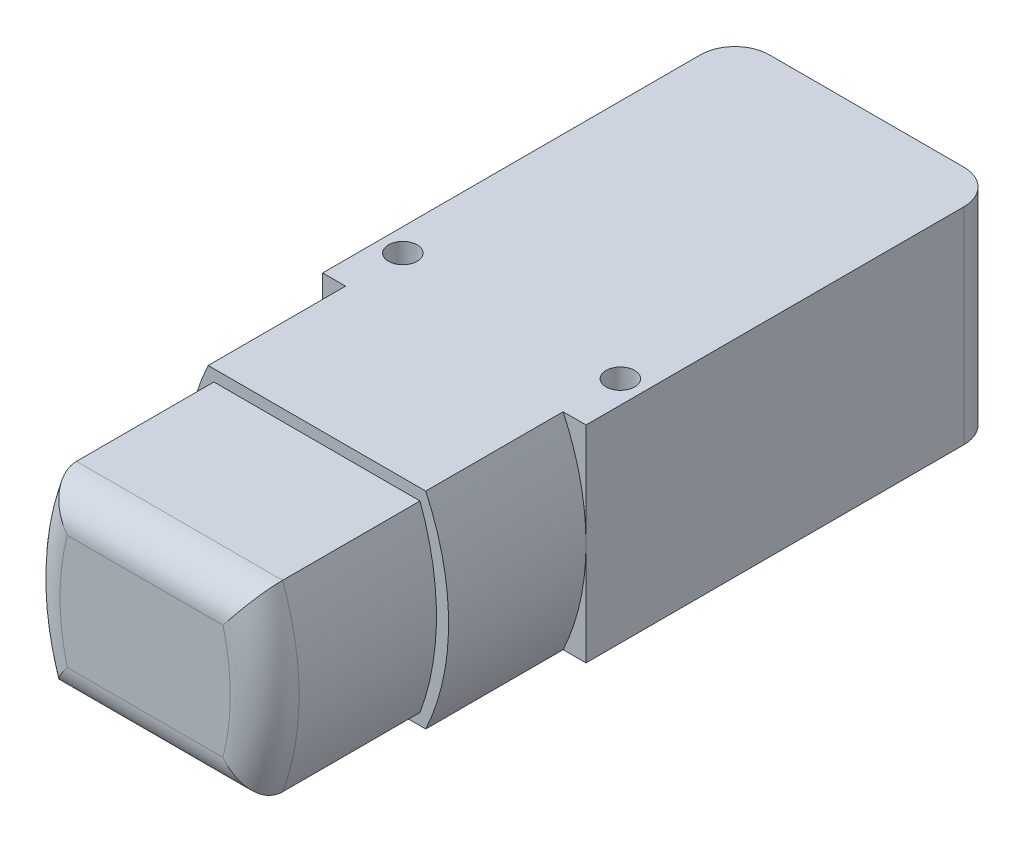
ISO-10303-21;
HEADER;
FILE_DESCRIPTION(('STEP AP214'),'2;1');
FILE_NAME('part.step','',(''),(''),'','','');
FILE_SCHEMA(('AUTOMOTIVE_DESIGN { 1 0 10303 214 1 1 1 1 }'));
ENDSEC;
DATA;
#1=APPLICATION_CONTEXT('core data for automotive mechanical design processes');
#2=APPLICATION_PROTOCOL_DEFINITION('international standard','automotive_design',2000,#1);
#3=PRODUCT_CONTEXT('',#1,'mechanical');
#4=PRODUCT('Part','Part','',(#3));
#5=PRODUCT_RELATED_PRODUCT_CATEGORY('part','',(#4));
#6=PRODUCT_DEFINITION_FORMATION('','',#4);
#7=PRODUCT_DEFINITION_CONTEXT('part definition',#1,'design');
#8=PRODUCT_DEFINITION('design','',#6,#7);
#9=PRODUCT_DEFINITION_SHAPE('','',#8);
#10=(LENGTH_UNIT() NAMED_UNIT(*) SI_UNIT(.MILLI.,.METRE.));
#11=(NAMED_UNIT(*) PLANE_ANGLE_UNIT() SI_UNIT($,.RADIAN.));
#12=(NAMED_UNIT(*) SI_UNIT($,.STERADIAN.) SOLID_ANGLE_UNIT());
#13=UNCERTAINTY_MEASURE_WITH_UNIT(LENGTH_MEASURE(1.E-05),#10,'distance_accuracy_value','');
#14=(GEOMETRIC_REPRESENTATION_CONTEXT(3) GLOBAL_UNCERTAINTY_ASSIGNED_CONTEXT((#13)) GLOBAL_UNIT_ASSIGNED_CONTEXT((#10,
#11,#12)) REPRESENTATION_CONTEXT('',''));
#15=CARTESIAN_POINT('',(0.,0.,0.));
#16=DIRECTION('',(0.,0.,1.));
#17=DIRECTION('',(1.,0.,0.));
#18=AXIS2_PLACEMENT_3D('',#15,#16,#17);
#19=CARTESIAN_POINT('',(9.75000000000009,0.,48.));
#20=DIRECTION('',(0.,0.,1.));
#21=DIRECTION('',(1.,0.,0.));
#22=AXIS2_PLACEMENT_3D('',#19,#20,#21);
#23=PLANE('',#22);
#24=CARTESIAN_POINT('',(9.75000000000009,0.,48.));
#25=DIRECTION('',(0.,0.,1.));
#26=DIRECTION('',(1.,0.,0.));
#27=AXIS2_PLACEMENT_3D('',#24,#25,#26);
#28=CIRCLE('',#27,21.2500000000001);
#29=CARTESIAN_POINT('',(-9.5,9.,48.));
#30=VERTEX_POINT('',#29);
#31=CARTESIAN_POINT('',(-9.5,-9.,48.));
#32=VERTEX_POINT('',#31);
#33=EDGE_CURVE('E194',#30,#32,#28,.T.);
#34=ORIENTED_EDGE('',*,*,#33,.T.);
#35=DIRECTION('',(1.,0.,0.));
#36=VECTOR('',#35,1.);
#37=CARTESIAN_POINT('',(-9.5,-9.,48.));
#38=LINE('',#37,#36);
#39=CARTESIAN_POINT('',(9.5,-8.99999999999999,48.));
#40=VERTEX_POINT('',#39);
#41=EDGE_CURVE('E197',#32,#40,#38,.T.);
#42=ORIENTED_EDGE('',*,*,#41,.T.);
#43=CARTESIAN_POINT('',(-9.75000000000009,0.,48.));
#44=DIRECTION('',(0.,0.,1.));
#45=DIRECTION('',(-1.,0.,0.));
#46=AXIS2_PLACEMENT_3D('',#43,#44,#45);
#47=CIRCLE('',#46,21.2500000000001);
#48=CARTESIAN_POINT('',(9.5,9.,48.));
#49=VERTEX_POINT('',#48);
#50=EDGE_CURVE('E200',#40,#49,#47,.T.);
#51=ORIENTED_EDGE('',*,*,#50,.T.);
#52=DIRECTION('',(-1.,0.,0.));
#53=VECTOR('',#52,1.);
#54=CARTESIAN_POINT('',(-9.5,9.,48.));
#55=LINE('',#54,#53);
#56=EDGE_CURVE('E202',#49,#30,#55,.T.);
#57=ORIENTED_EDGE('',*,*,#56,.T.);
#58=EDGE_LOOP('',(#34,#42,#51,#57));
#59=FACE_BOUND('',#58,.T.);
#60=DIRECTION('',(1.,0.,0.));
#61=VECTOR('',#60,1.);
#62=CARTESIAN_POINT('',(-9.,-8.,48.));
#63=LINE('',#62,#61);
#64=CARTESIAN_POINT('',(-9.,-8.,48.));
#65=VERTEX_POINT('',#64);
#66=CARTESIAN_POINT('',(9.,-7.99999999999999,48.));
#67=VERTEX_POINT('',#66);
#68=EDGE_CURVE('E169',#65,#67,#63,.T.);
#69=ORIENTED_EDGE('',*,*,#68,.F.);
#70=CARTESIAN_POINT('',(12.5638586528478,0.,48.));
#71=DIRECTION('',(0.,0.,1.));
#72=DIRECTION('',(1.,0.,0.));
#73=AXIS2_PLACEMENT_3D('',#70,#71,#72);
#74=CIRCLE('',#73,23.);
#75=CARTESIAN_POINT('',(-9.,8.,48.));
#76=VERTEX_POINT('',#75);
#77=EDGE_CURVE('E175',#76,#65,#74,.T.);
#78=ORIENTED_EDGE('',*,*,#77,.F.);
#79=DIRECTION('',(-1.,0.,0.));
#80=VECTOR('',#79,1.);
#81=CARTESIAN_POINT('',(-9.,8.,48.));
#82=LINE('',#81,#80);
#83=CARTESIAN_POINT('',(9.,8.,48.));
#84=VERTEX_POINT('',#83);
#85=EDGE_CURVE('E185',#84,#76,#82,.T.);
#86=ORIENTED_EDGE('',*,*,#85,.F.);
#87=CARTESIAN_POINT('',(-12.5638586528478,0.,48.));
#88=DIRECTION('',(0.,0.,1.));
#89=DIRECTION('',(-1.,0.,0.));
#90=AXIS2_PLACEMENT_3D('',#87,#88,#89);
#91=CIRCLE('',#90,23.);
#92=EDGE_CURVE('E183',#67,#84,#91,.T.);
#93=ORIENTED_EDGE('',*,*,#92,.F.);
#94=EDGE_LOOP('',(#69,#78,#86,#93));
#95=FACE_BOUND('',#94,.T.);
#96=ADVANCED_FACE('F44',(#59,#95),#23,.T.);
#97=CARTESIAN_POINT('',(0.,0.,36.));
#98=DIRECTION('',(0.,0.,1.));
#99=DIRECTION('',(1.,0.,0.));
#100=AXIS2_PLACEMENT_3D('',#97,#98,#99);
#101=PLANE('',#100);
#102=CARTESIAN_POINT('',(9.75000000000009,0.,36.));
#103=DIRECTION('',(0.,0.,1.));
#104=DIRECTION('',(1.,0.,0.));
#105=AXIS2_PLACEMENT_3D('',#102,#103,#104);
#106=CIRCLE('',#105,21.2500000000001);
#107=CARTESIAN_POINT('',(-9.5,9.,36.));
#108=VERTEX_POINT('',#107);
#109=CARTESIAN_POINT('',(-11.5,0.,36.));
#110=VERTEX_POINT('',#109);
#111=EDGE_CURVE('E171',#108,#110,#106,.T.);
#112=ORIENTED_EDGE('',*,*,#111,.F.);
#113=DIRECTION('',(-1.,0.,0.));
#114=VECTOR('',#113,1.);
#115=CARTESIAN_POINT('',(-11.5,9.,36.));
#116=LINE('',#115,#114);
#117=CARTESIAN_POINT('',(-11.5,9.,36.));
#118=VERTEX_POINT('',#117);
#119=EDGE_CURVE('E226',#108,#118,#116,.T.);
#120=ORIENTED_EDGE('',*,*,#119,.T.);
#121=DIRECTION('',(0.,-1.,0.));
#122=VECTOR('',#121,1.);
#123=CARTESIAN_POINT('',(-11.5,9.,36.));
#124=LINE('',#123,#122);
#125=EDGE_CURVE('E231',#118,#110,#124,.T.);
#126=ORIENTED_EDGE('',*,*,#125,.T.);
#127=EDGE_LOOP('',(#112,#120,#126));
#128=FACE_BOUND('',#127,.T.);
#129=ADVANCED_FACE('F342',(#128),#101,.T.);
#130=CARTESIAN_POINT('',(-9.5,-9.,36.));
#131=VERTEX_POINT('',#130);
#132=EDGE_CURVE('E207',#110,#131,#106,.T.);
#133=ORIENTED_EDGE('',*,*,#132,.F.);
#134=CARTESIAN_POINT('',(-11.5,-9.,36.));
#135=VERTEX_POINT('',#134);
#136=EDGE_CURVE('E230',#110,#135,#124,.T.);
#137=ORIENTED_EDGE('',*,*,#136,.T.);
#138=DIRECTION('',(1.,0.,0.));
#139=VECTOR('',#138,1.);
#140=CARTESIAN_POINT('',(-11.5,-9.,36.));
#141=LINE('',#140,#139);
#142=EDGE_CURVE('E235',#135,#131,#141,.T.);
#143=ORIENTED_EDGE('',*,*,#142,.T.);
#144=EDGE_LOOP('',(#133,#137,#143));
#145=FACE_BOUND('',#144,.T.);
#146=ADVANCED_FACE('F348',(#145),#101,.T.);
#147=CARTESIAN_POINT('',(-9.75000000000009,0.,36.));
#148=DIRECTION('',(0.,0.,1.));
#149=DIRECTION('',(-1.,0.,0.));
#150=AXIS2_PLACEMENT_3D('',#147,#148,#149);
#151=CIRCLE('',#150,21.2500000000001);
#152=CARTESIAN_POINT('',(9.5,-9.,36.));
#153=VERTEX_POINT('',#152);
#154=CARTESIAN_POINT('',(11.5,0.,36.));
#155=VERTEX_POINT('',#154);
#156=EDGE_CURVE('E198',#153,#155,#151,.T.);
#157=ORIENTED_EDGE('',*,*,#156,.F.);
#158=CARTESIAN_POINT('',(11.5,-9.,36.));
#159=VERTEX_POINT('',#158);
#160=EDGE_CURVE('E234',#153,#159,#141,.T.);
#161=ORIENTED_EDGE('',*,*,#160,.T.);
#162=DIRECTION('',(0.,1.,0.));
#163=VECTOR('',#162,1.);
#164=CARTESIAN_POINT('',(11.5,9.,36.));
#165=LINE('',#164,#163);
#166=EDGE_CURVE('E223',#159,#155,#165,.T.);
#167=ORIENTED_EDGE('',*,*,#166,.T.);
#168=EDGE_LOOP('',(#157,#161,#167));
#169=FACE_BOUND('',#168,.T.);
#170=ADVANCED_FACE('F368',(#169),#101,.T.);
#171=CARTESIAN_POINT('',(11.5,9.,36.));
#172=DIRECTION('',(-1.,0.,0.));
#173=DIRECTION('',(0.,-1.,0.));
#174=AXIS2_PLACEMENT_3D('',#171,#172,#173);
#175=PLANE('',#174);
#176=DIRECTION('',(0.,0.,-1.));
#177=VECTOR('',#176,1.);
#178=CARTESIAN_POINT('',(11.5,-9.,36.));
#179=LINE('',#178,#177);
#180=CARTESIAN_POINT('',(11.5,-9.,3.));
#181=VERTEX_POINT('',#180);
#182=EDGE_CURVE('E237',#159,#181,#179,.T.);
#183=ORIENTED_EDGE('',*,*,#182,.T.);
#184=DIRECTION('',(0.,1.,0.));
#185=VECTOR('',#184,1.);
#186=CARTESIAN_POINT('',(11.5,9.,3.));
#187=LINE('',#186,#185);
#188=CARTESIAN_POINT('',(11.5,9.,3.));
#189=VERTEX_POINT('',#188);
#190=EDGE_CURVE('E254',#181,#189,#187,.T.);
#191=ORIENTED_EDGE('',*,*,#190,.T.);
#192=DIRECTION('',(0.,0.,-1.));
#193=VECTOR('',#192,1.);
#194=CARTESIAN_POINT('',(11.5,9.,36.));
#195=LINE('',#194,#193);
#196=CARTESIAN_POINT('',(11.5,9.,36.));
#197=VERTEX_POINT('',#196);
#198=EDGE_CURVE('E251',#197,#189,#195,.T.);
#199=ORIENTED_EDGE('',*,*,#198,.F.);
#200=EDGE_CURVE('E227',#155,#197,#165,.T.);
#201=ORIENTED_EDGE('',*,*,#200,.F.);
#202=ORIENTED_EDGE('',*,*,#166,.F.);
#203=EDGE_LOOP('',(#183,#191,#199,#201,#202));
#204=FACE_BOUND('',#203,.T.);
#205=ADVANCED_FACE('F383',(#204),#175,.F.);
#206=CARTESIAN_POINT('',(-11.5,9.,36.));
#207=DIRECTION('',(0.,-1.,0.));
#208=DIRECTION('',(0.,0.,-1.));
#209=AXIS2_PLACEMENT_3D('',#206,#207,#208);
#210=PLANE('',#209);
#211=CARTESIAN_POINT('',(9.5,9.00000000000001,31.));
#212=DIRECTION('',(0.,-1.,0.));
#213=DIRECTION('',(0.,0.,-1.));
#214=AXIS2_PLACEMENT_3D('',#211,#212,#213);
#215=CIRCLE('',#214,1.25);
#216=CARTESIAN_POINT('',(9.5,9.00000000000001,29.75));
#217=VERTEX_POINT('',#216);
#218=EDGE_CURVE('E582',#217,#217,#215,.T.);
#219=ORIENTED_EDGE('',*,*,#218,.T.);
#220=EDGE_LOOP('',(#219));
#221=FACE_BOUND('',#220,.T.);
#222=CARTESIAN_POINT('',(-9.5,9.00000000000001,31.));
#223=DIRECTION('',(0.,-1.,0.));
#224=DIRECTION('',(0.,0.,-1.));
#225=AXIS2_PLACEMENT_3D('',#222,#223,#224);
#226=CIRCLE('',#225,1.25);
#227=CARTESIAN_POINT('',(-9.5,9.00000000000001,29.75));
#228=VERTEX_POINT('',#227);
#229=EDGE_CURVE('E295',#228,#228,#226,.T.);
#230=ORIENTED_EDGE('',*,*,#229,.T.);
#231=EDGE_LOOP('',(#230));
#232=FACE_BOUND('',#231,.T.);
#233=ORIENTED_EDGE('',*,*,#198,.T.);
#234=CARTESIAN_POINT('',(8.5,9.,3.));
#235=DIRECTION('',(0.,-1.,0.));
#236=DIRECTION('',(0.,0.,-1.));
#237=AXIS2_PLACEMENT_3D('',#234,#235,#236);
#238=CIRCLE('',#237,3.);
#239=CARTESIAN_POINT('',(8.49999999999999,9.,0.));
#240=VERTEX_POINT('',#239);
#241=EDGE_CURVE('E259',#189,#240,#238,.F.);
#242=ORIENTED_EDGE('',*,*,#241,.T.);
#243=DIRECTION('',(-1.,0.,0.));
#244=VECTOR('',#243,1.);
#245=CARTESIAN_POINT('',(-11.5,9.,0.));
#246=LINE('',#245,#244);
#247=CARTESIAN_POINT('',(-8.5,9.,0.));
#248=VERTEX_POINT('',#247);
#249=EDGE_CURVE('E222',#240,#248,#246,.T.);
#250=ORIENTED_EDGE('',*,*,#249,.T.);
#251=CARTESIAN_POINT('',(-8.5,9.,3.));
#252=DIRECTION('',(0.,-1.,0.));
#253=DIRECTION('',(0.,0.,-1.));
#254=AXIS2_PLACEMENT_3D('',#251,#252,#253);
#255=CIRCLE('',#254,3.);
#256=CARTESIAN_POINT('',(-11.5,9.,3.));
#257=VERTEX_POINT('',#256);
#258=EDGE_CURVE('E257',#248,#257,#255,.F.);
#259=ORIENTED_EDGE('',*,*,#258,.T.);
#260=DIRECTION('',(0.,0.,-1.));
#261=VECTOR('',#260,1.);
#262=CARTESIAN_POINT('',(-11.5,9.,36.));
#263=LINE('',#262,#261);
#264=EDGE_CURVE('E248',#118,#257,#263,.T.);
#265=ORIENTED_EDGE('',*,*,#264,.F.);
#266=ORIENTED_EDGE('',*,*,#119,.F.);
#267=DIRECTION('',(0.,0.,-1.));
#268=VECTOR('',#267,1.);
#269=CARTESIAN_POINT('',(-9.5,9.,48.));
#270=LINE('',#269,#268);
#271=EDGE_CURVE('E204',#30,#108,#270,.T.);
#272=ORIENTED_EDGE('',*,*,#271,.F.);
#273=ORIENTED_EDGE('',*,*,#56,.F.);
#274=DIRECTION('',(0.,0.,-1.));
#275=VECTOR('',#274,1.);
#276=CARTESIAN_POINT('',(9.5,9.,48.));
#277=LINE('',#276,#275);
#278=CARTESIAN_POINT('',(9.5,9.,36.));
#279=VERTEX_POINT('',#278);
#280=EDGE_CURVE('E213',#49,#279,#277,.T.);
#281=ORIENTED_EDGE('',*,*,#280,.T.);
#282=EDGE_CURVE('E228',#197,#279,#116,.T.);
#283=ORIENTED_EDGE('',*,*,#282,.F.);
#284=EDGE_LOOP('',(#233,#242,#250,#259,#265,#266,#272,#273,#281,#283));
#285=FACE_BOUND('',#284,.T.);
#286=ADVANCED_FACE('F379',(#221,#232,#285),#210,.F.);
#287=CARTESIAN_POINT('',(-11.5,9.,36.));
#288=DIRECTION('',(1.,0.,0.));
#289=DIRECTION('',(0.,1.,0.));
#290=AXIS2_PLACEMENT_3D('',#287,#288,#289);
#291=PLANE('',#290);
#292=ORIENTED_EDGE('',*,*,#264,.T.);
#293=DIRECTION('',(0.,-1.,0.));
#294=VECTOR('',#293,1.);
#295=CARTESIAN_POINT('',(-11.5,9.,3.));
#296=LINE('',#295,#294);
#297=CARTESIAN_POINT('',(-11.5,-9.,3.));
#298=VERTEX_POINT('',#297);
#299=EDGE_CURVE('E269',#257,#298,#296,.T.);
#300=ORIENTED_EDGE('',*,*,#299,.T.);
#301=DIRECTION('',(0.,0.,-1.));
#302=VECTOR('',#301,1.);
#303=CARTESIAN_POINT('',(-11.5,-9.,36.));
#304=LINE('',#303,#302);
#305=EDGE_CURVE('E245',#135,#298,#304,.T.);
#306=ORIENTED_EDGE('',*,*,#305,.F.);
#307=ORIENTED_EDGE('',*,*,#136,.F.);
#308=ORIENTED_EDGE('',*,*,#125,.F.);
#309=EDGE_LOOP('',(#292,#300,#306,#307,#308));
#310=FACE_BOUND('',#309,.T.);
#311=ADVANCED_FACE('F375',(#310),#291,.F.);
#312=CARTESIAN_POINT('',(-11.5,-9.,36.));
#313=DIRECTION('',(0.,1.,0.));
#314=DIRECTION('',(0.,0.,1.));
#315=AXIS2_PLACEMENT_3D('',#312,#313,#314);
#316=PLANE('',#315);
#317=CARTESIAN_POINT('',(9.5,-9.,31.));
#318=DIRECTION('',(0.,-1.,0.));
#319=DIRECTION('',(0.,0.,-1.));
#320=AXIS2_PLACEMENT_3D('',#317,#318,#319);
#321=CIRCLE('',#320,1.25);
#322=CARTESIAN_POINT('',(9.5,-9.,29.75));
#323=VERTEX_POINT('',#322);
#324=EDGE_CURVE('E585',#323,#323,#321,.T.);
#325=ORIENTED_EDGE('',*,*,#324,.F.);
#326=EDGE_LOOP('',(#325));
#327=FACE_BOUND('',#326,.T.);
#328=CARTESIAN_POINT('',(-9.5,-9.,31.));
#329=DIRECTION('',(0.,-1.,0.));
#330=DIRECTION('',(0.,0.,-1.));
#331=AXIS2_PLACEMENT_3D('',#328,#329,#330);
#332=CIRCLE('',#331,1.25);
#333=CARTESIAN_POINT('',(-9.5,-9.,29.75));
#334=VERTEX_POINT('',#333);
#335=EDGE_CURVE('E587',#334,#334,#332,.T.);
#336=ORIENTED_EDGE('',*,*,#335,.F.);
#337=EDGE_LOOP('',(#336));
#338=FACE_BOUND('',#337,.T.);
#339=DIRECTION('',(1.,0.,0.));
#340=VECTOR('',#339,1.);
#341=CARTESIAN_POINT('',(-11.5,-9.,0.));
#342=LINE('',#341,#340);
#343=CARTESIAN_POINT('',(-8.5,-9.,0.));
#344=VERTEX_POINT('',#343);
#345=CARTESIAN_POINT('',(8.5,-9.,0.));
#346=VERTEX_POINT('',#345);
#347=EDGE_CURVE('E240',#344,#346,#342,.T.);
#348=ORIENTED_EDGE('',*,*,#347,.T.);
#349=CARTESIAN_POINT('',(8.5,-9.,3.));
#350=DIRECTION('',(0.,1.,0.));
#351=DIRECTION('',(0.,0.,1.));
#352=AXIS2_PLACEMENT_3D('',#349,#350,#351);
#353=CIRCLE('',#352,3.);
#354=EDGE_CURVE('E267',#346,#181,#353,.F.);
#355=ORIENTED_EDGE('',*,*,#354,.T.);
#356=ORIENTED_EDGE('',*,*,#182,.F.);
#357=ORIENTED_EDGE('',*,*,#160,.F.);
#358=DIRECTION('',(0.,0.,-1.));
#359=VECTOR('',#358,1.);
#360=CARTESIAN_POINT('',(9.5,-8.99999999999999,48.));
#361=LINE('',#360,#359);
#362=EDGE_CURVE('E216',#40,#153,#361,.T.);
#363=ORIENTED_EDGE('',*,*,#362,.F.);
#364=ORIENTED_EDGE('',*,*,#41,.F.);
#365=DIRECTION('',(0.,0.,-1.));
#366=VECTOR('',#365,1.);
#367=CARTESIAN_POINT('',(-9.5,-9.,48.));
#368=LINE('',#367,#366);
#369=EDGE_CURVE('E219',#32,#131,#368,.T.);
#370=ORIENTED_EDGE('',*,*,#369,.T.);
#371=ORIENTED_EDGE('',*,*,#142,.F.);
#372=ORIENTED_EDGE('',*,*,#305,.T.);
#373=CARTESIAN_POINT('',(-8.5,-9.,3.));
#374=DIRECTION('',(0.,1.,0.));
#375=DIRECTION('',(0.,0.,1.));
#376=AXIS2_PLACEMENT_3D('',#373,#374,#375);
#377=CIRCLE('',#376,3.);
#378=EDGE_CURVE('E265',#298,#344,#377,.F.);
#379=ORIENTED_EDGE('',*,*,#378,.T.);
#380=EDGE_LOOP('',(#348,#355,#356,#357,#363,#364,#370,#371,#372,#379));
#381=FACE_BOUND('',#380,.T.);
#382=ADVANCED_FACE('F366',(#327,#338,#381),#316,.F.);
#383=EDGE_CURVE('E210',#155,#279,#151,.T.);
#384=ORIENTED_EDGE('',*,*,#383,.F.);
#385=ORIENTED_EDGE('',*,*,#200,.T.);
#386=ORIENTED_EDGE('',*,*,#282,.T.);
#387=EDGE_LOOP('',(#384,#385,#386));
#388=FACE_BOUND('',#387,.T.);
#389=ADVANCED_FACE('F351',(#388),#101,.T.);
#390=CARTESIAN_POINT('',(0.,0.,0.));
#391=DIRECTION('',(0.,0.,1.));
#392=DIRECTION('',(1.,0.,0.));
#393=AXIS2_PLACEMENT_3D('',#390,#391,#392);
#394=PLANE('',#393);
#395=ORIENTED_EDGE('',*,*,#249,.F.);
#396=DIRECTION('',(0.,1.,0.));
#397=VECTOR('',#396,1.);
#398=CARTESIAN_POINT('',(8.5,0.,0.));
#399=LINE('',#398,#397);
#400=EDGE_CURVE('E263',#240,#346,#399,.F.);
#401=ORIENTED_EDGE('',*,*,#400,.T.);
#402=ORIENTED_EDGE('',*,*,#347,.F.);
#403=DIRECTION('',(0.,-1.,0.));
#404=VECTOR('',#403,1.);
#405=CARTESIAN_POINT('',(-8.5,0.,0.));
#406=LINE('',#405,#404);
#407=EDGE_CURVE('E261',#344,#248,#406,.F.);
#408=ORIENTED_EDGE('',*,*,#407,.T.);
#409=EDGE_LOOP('',(#395,#401,#402,#408));
#410=FACE_BOUND('',#409,.T.);
#411=ADVANCED_FACE('F365',(#410),#394,.F.);
#412=CARTESIAN_POINT('',(8.5,9.,3.));
#413=DIRECTION('',(0.,1.,0.));
#414=DIRECTION('',(-1.,0.,0.));
#415=AXIS2_PLACEMENT_3D('',#412,#413,#414);
#416=CYLINDRICAL_SURFACE('',#415,3.);
#417=ORIENTED_EDGE('',*,*,#354,.F.);
#418=ORIENTED_EDGE('',*,*,#400,.F.);
#419=ORIENTED_EDGE('',*,*,#241,.F.);
#420=ORIENTED_EDGE('',*,*,#190,.F.);
#421=EDGE_LOOP('',(#417,#418,#419,#420));
#422=FACE_BOUND('',#421,.T.);
#423=ADVANCED_FACE('F371',(#422),#416,.T.);
#424=CARTESIAN_POINT('',(-8.5,9.,3.));
#425=DIRECTION('',(0.,-1.,0.));
#426=DIRECTION('',(1.,0.,0.));
#427=AXIS2_PLACEMENT_3D('',#424,#425,#426);
#428=CYLINDRICAL_SURFACE('',#427,3.);
#429=ORIENTED_EDGE('',*,*,#258,.F.);
#430=ORIENTED_EDGE('',*,*,#407,.F.);
#431=ORIENTED_EDGE('',*,*,#378,.F.);
#432=ORIENTED_EDGE('',*,*,#299,.F.);
#433=EDGE_LOOP('',(#429,#430,#431,#432));
#434=FACE_BOUND('',#433,.T.);
#435=ADVANCED_FACE('F361',(#434),#428,.T.);
#436=CARTESIAN_POINT('',(9.75000000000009,0.,48.));
#437=DIRECTION('',(0.,0.,-1.));
#438=DIRECTION('',(-1.,0.,0.));
#439=AXIS2_PLACEMENT_3D('',#436,#437,#438);
#440=CYLINDRICAL_SURFACE('',#439,21.2500000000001);
#441=ORIENTED_EDGE('',*,*,#111,.T.);
#442=ORIENTED_EDGE('',*,*,#132,.T.);
#443=ORIENTED_EDGE('',*,*,#369,.F.);
#444=ORIENTED_EDGE('',*,*,#33,.F.);
#445=ORIENTED_EDGE('',*,*,#271,.T.);
#446=EDGE_LOOP('',(#441,#442,#443,#444,#445));
#447=FACE_BOUND('',#446,.T.);
#448=ADVANCED_FACE('F358',(#447),#440,.T.);
#449=CARTESIAN_POINT('',(-9.75000000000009,0.,48.));
#450=DIRECTION('',(0.,0.,-1.));
#451=DIRECTION('',(-1.,0.,0.));
#452=AXIS2_PLACEMENT_3D('',#449,#450,#451);
#453=CYLINDRICAL_SURFACE('',#452,21.2500000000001);
#454=ORIENTED_EDGE('',*,*,#156,.T.);
#455=ORIENTED_EDGE('',*,*,#383,.T.);
#456=ORIENTED_EDGE('',*,*,#280,.F.);
#457=ORIENTED_EDGE('',*,*,#50,.F.);
#458=ORIENTED_EDGE('',*,*,#362,.T.);
#459=EDGE_LOOP('',(#454,#455,#456,#457,#458));
#460=FACE_BOUND('',#459,.T.);
#461=ADVANCED_FACE('F355',(#460),#453,.T.);
#462=CARTESIAN_POINT('',(12.5638586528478,0.,63.));
#463=DIRECTION('',(0.,0.,-1.));
#464=DIRECTION('',(-1.,0.,0.));
#465=AXIS2_PLACEMENT_3D('',#462,#463,#464);
#466=CYLINDRICAL_SURFACE('',#465,23.);
#467=DIRECTION('',(0.,0.,-1.));
#468=VECTOR('',#467,1.);
#469=CARTESIAN_POINT('',(-9.,-8.,63.));
#470=LINE('',#469,#468);
#471=CARTESIAN_POINT('',(-9.,-8.,60.));
#472=VERTEX_POINT('',#471);
#473=EDGE_CURVE('E165',#472,#65,#470,.T.);
#474=ORIENTED_EDGE('',*,*,#473,.F.);
#475=CARTESIAN_POINT('',(12.5638586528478,0.,60.));
#476=DIRECTION('',(0.,0.,1.));
#477=DIRECTION('',(1.,0.,0.));
#478=AXIS2_PLACEMENT_3D('',#475,#476,#477);
#479=CIRCLE('',#478,23.);
#480=CARTESIAN_POINT('',(-9.,8.,60.));
#481=VERTEX_POINT('',#480);
#482=EDGE_CURVE('E57',#472,#481,#479,.F.);
#483=ORIENTED_EDGE('',*,*,#482,.T.);
#484=DIRECTION('',(0.,0.,-1.));
#485=VECTOR('',#484,1.);
#486=CARTESIAN_POINT('',(-9.,8.,63.));
#487=LINE('',#486,#485);
#488=EDGE_CURVE('E177',#481,#76,#487,.T.);
#489=ORIENTED_EDGE('',*,*,#488,.T.);
#490=ORIENTED_EDGE('',*,*,#77,.T.);
#491=EDGE_LOOP('',(#474,#483,#489,#490));
#492=FACE_BOUND('',#491,.T.);
#493=ADVANCED_FACE('F176',(#492),#466,.T.);
#494=CARTESIAN_POINT('',(-9.,-8.,63.));
#495=DIRECTION('',(0.,1.,0.));
#496=DIRECTION('',(-1.,0.,0.));
#497=AXIS2_PLACEMENT_3D('',#494,#495,#496);
#498=PLANE('',#497);
#499=DIRECTION('',(0.,0.,-1.));
#500=VECTOR('',#499,1.);
#501=CARTESIAN_POINT('',(9.,-7.99999999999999,63.));
#502=LINE('',#501,#500);
#503=CARTESIAN_POINT('',(9.,-7.99999999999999,60.));
#504=VERTEX_POINT('',#503);
#505=EDGE_CURVE('E172',#504,#67,#502,.T.);
#506=ORIENTED_EDGE('',*,*,#505,.F.);
#507=DIRECTION('',(1.,0.,0.));
#508=VECTOR('',#507,1.);
#509=CARTESIAN_POINT('',(-9.,-8.,60.));
#510=LINE('',#509,#508);
#511=EDGE_CURVE('E13',#504,#472,#510,.F.);
#512=ORIENTED_EDGE('',*,*,#511,.T.);
#513=ORIENTED_EDGE('',*,*,#473,.T.);
#514=ORIENTED_EDGE('',*,*,#68,.T.);
#515=EDGE_LOOP('',(#506,#512,#513,#514));
#516=FACE_BOUND('',#515,.T.);
#517=ADVANCED_FACE('F167',(#516),#498,.F.);
#518=CARTESIAN_POINT('',(-12.5638586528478,0.,63.));
#519=DIRECTION('',(0.,0.,-1.));
#520=DIRECTION('',(-1.,0.,0.));
#521=AXIS2_PLACEMENT_3D('',#518,#519,#520);
#522=CYLINDRICAL_SURFACE('',#521,23.);
#523=DIRECTION('',(0.,0.,-1.));
#524=VECTOR('',#523,1.);
#525=CARTESIAN_POINT('',(9.,8.,63.));
#526=LINE('',#525,#524);
#527=CARTESIAN_POINT('',(9.,8.,60.));
#528=VERTEX_POINT('',#527);
#529=EDGE_CURVE('E191',#528,#84,#526,.T.);
#530=ORIENTED_EDGE('',*,*,#529,.F.);
#531=CARTESIAN_POINT('',(-12.5638586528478,0.,60.));
#532=DIRECTION('',(0.,0.,1.));
#533=DIRECTION('',(1.,0.,0.));
#534=AXIS2_PLACEMENT_3D('',#531,#532,#533);
#535=CIRCLE('',#534,23.);
#536=EDGE_CURVE('E281',#528,#504,#535,.F.);
#537=ORIENTED_EDGE('',*,*,#536,.T.);
#538=ORIENTED_EDGE('',*,*,#505,.T.);
#539=ORIENTED_EDGE('',*,*,#92,.T.);
#540=EDGE_LOOP('',(#530,#537,#538,#539));
#541=FACE_BOUND('',#540,.T.);
#542=ADVANCED_FACE('F328',(#541),#522,.T.);
#543=CARTESIAN_POINT('',(-9.,8.,63.));
#544=DIRECTION('',(0.,-1.,0.));
#545=DIRECTION('',(0.,0.,-1.));
#546=AXIS2_PLACEMENT_3D('',#543,#544,#545);
#547=PLANE('',#546);
#548=ORIENTED_EDGE('',*,*,#488,.F.);
#549=DIRECTION('',(-1.,0.,0.));
#550=VECTOR('',#549,1.);
#551=CARTESIAN_POINT('',(9.,8.,60.));
#552=LINE('',#551,#550);
#553=EDGE_CURVE('E284',#481,#528,#552,.F.);
#554=ORIENTED_EDGE('',*,*,#553,.T.);
#555=ORIENTED_EDGE('',*,*,#529,.T.);
#556=ORIENTED_EDGE('',*,*,#85,.T.);
#557=EDGE_LOOP('',(#548,#554,#555,#556));
#558=FACE_BOUND('',#557,.T.);
#559=ADVANCED_FACE('F330',(#558),#547,.F.);
#560=CARTESIAN_POINT('',(12.5638586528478,0.,63.));
#561=DIRECTION('',(0.,0.,1.));
#562=DIRECTION('',(1.,0.,0.));
#563=AXIS2_PLACEMENT_3D('',#560,#561,#562);
#564=PLANE('',#563);
#565=DIRECTION('',(1.,0.,0.));
#566=VECTOR('',#565,1.);
#567=CARTESIAN_POINT('',(9.,-5.,63.));
#568=LINE('',#567,#566);
#569=CARTESIAN_POINT('',(-6.80105807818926,-5.,63.));
#570=VERTEX_POINT('',#569);
#571=CARTESIAN_POINT('',(6.80105807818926,-5.,63.));
#572=VERTEX_POINT('',#571);
#573=EDGE_CURVE('E272',#570,#572,#568,.T.);
#574=ORIENTED_EDGE('',*,*,#573,.T.);
#575=CARTESIAN_POINT('',(-12.5638586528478,0.,63.));
#576=DIRECTION('',(0.,0.,1.));
#577=DIRECTION('',(1.,0.,0.));
#578=AXIS2_PLACEMENT_3D('',#575,#576,#577);
#579=CIRCLE('',#578,20.);
#580=CARTESIAN_POINT('',(6.80105807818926,5.,63.));
#581=VERTEX_POINT('',#580);
#582=EDGE_CURVE('E278',#572,#581,#579,.T.);
#583=ORIENTED_EDGE('',*,*,#582,.T.);
#584=DIRECTION('',(-1.,0.,0.));
#585=VECTOR('',#584,1.);
#586=CARTESIAN_POINT('',(-9.,5.,63.));
#587=LINE('',#586,#585);
#588=CARTESIAN_POINT('',(-6.80105807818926,5.,63.));
#589=VERTEX_POINT('',#588);
#590=EDGE_CURVE('E276',#581,#589,#587,.T.);
#591=ORIENTED_EDGE('',*,*,#590,.T.);
#592=CARTESIAN_POINT('',(12.5638586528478,0.,63.));
#593=DIRECTION('',(0.,0.,1.));
#594=DIRECTION('',(1.,0.,0.));
#595=AXIS2_PLACEMENT_3D('',#592,#593,#594);
#596=CIRCLE('',#595,20.);
#597=EDGE_CURVE('E274',#589,#570,#596,.T.);
#598=ORIENTED_EDGE('',*,*,#597,.T.);
#599=EDGE_LOOP('',(#574,#583,#591,#598));
#600=FACE_BOUND('',#599,.T.);
#601=ADVANCED_FACE('F333',(#600),#564,.T.);
#602=CARTESIAN_POINT('',(12.5638586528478,0.,60.));
#603=DIRECTION('',(0.,0.,1.));
#604=DIRECTION('',(1.,0.,0.));
#605=AXIS2_PLACEMENT_3D('',#602,#603,#604);
#606=TOROIDAL_SURFACE('',#605,20.,3.);
#607=CARTESIAN_POINT('',(-9.,8.,60.));
#608=CARTESIAN_POINT('',(-9.00000879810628,8.00001410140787,60.0734416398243));
#609=CARTESIAN_POINT('',(-8.9981243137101,7.99730356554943,60.1468749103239));
#610=CARTESIAN_POINT('',(-8.99063643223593,7.98654109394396,60.2931286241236));
#611=CARTESIAN_POINT('',(-8.98503457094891,7.97849136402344,60.3659493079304));
#612=CARTESIAN_POINT('',(-8.9702175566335,7.9572128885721,60.510073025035));
#613=CARTESIAN_POINT('',(-8.96102107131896,7.94401090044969,60.5813819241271));
#614=CARTESIAN_POINT('',(-8.93914614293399,7.9126365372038,60.722336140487));
#615=CARTESIAN_POINT('',(-8.9264674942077,7.8944638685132,60.791981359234));
#616=CARTESIAN_POINT('',(-8.88346796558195,7.83289967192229,60.9975276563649));
#617=CARTESIAN_POINT('',(-8.84815027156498,7.78241402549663,61.1303549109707));
#618=CARTESIAN_POINT('',(-8.76577493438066,7.66505271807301,61.3846214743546));
#619=CARTESIAN_POINT('',(-8.71870473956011,7.59815953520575,61.5060484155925));
#620=CARTESIAN_POINT('',(-8.61137784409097,7.44625316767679,61.7426388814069));
#621=CARTESIAN_POINT('',(-8.55048901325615,7.36037969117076,61.8569602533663));
#622=CARTESIAN_POINT('',(-8.41950268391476,7.17657202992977,62.0693699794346));
#623=CARTESIAN_POINT('',(-8.34940274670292,7.07863465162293,62.1674540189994));
#624=CARTESIAN_POINT('',(-8.1893585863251,6.85628689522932,62.3621063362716));
#625=CARTESIAN_POINT('',(-8.09806063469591,6.73019602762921,62.4556367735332));
#626=CARTESIAN_POINT('',(-7.90778870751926,6.46930905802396,62.6201062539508));
#627=CARTESIAN_POINT('',(-7.80880677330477,6.3345039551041,62.6910214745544));
#628=CARTESIAN_POINT('',(-7.58570104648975,6.03300194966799,62.8222123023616));
#629=CARTESIAN_POINT('',(-7.46039991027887,5.86515285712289,62.8778278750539));
#630=CARTESIAN_POINT('',(-7.20491723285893,5.52627365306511,62.958603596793));
#631=CARTESIAN_POINT('',(-7.07474216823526,5.35524790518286,62.9838027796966));
#632=CARTESIAN_POINT('',(-6.89835818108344,5.12586132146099,62.9979335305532));
#633=CARTESIAN_POINT('',(-6.8531675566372,5.06729516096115,62.9998155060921));
#634=CARTESIAN_POINT('',(-6.80560271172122,5.00586761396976,62.9999956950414));
#635=CARTESIAN_POINT('',(-6.80333052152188,5.00293371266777,62.9999999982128));
#636=CARTESIAN_POINT('',(-6.80105807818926,5.,63.));
#637=B_SPLINE_CURVE_WITH_KNOTS('',3,(#607,#608,#609,#610,#611,#612,#613,#614,#615,#616,#617,
#618,#619,#620,#621,#622,#623,#624,#625,#626,#627,#628,#629,#630,#631,#632,#633,#634,#635,#636),
.UNSPECIFIED.,.F.,.F.,(4,2,2,2,2,2,2,2,2,2,2,2,2,2,4),(0.,0.220236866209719,0.440382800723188,
0.659400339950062,0.878430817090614,1.31554155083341,1.75312113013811,2.21756404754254,
2.68213017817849,3.22494355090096,3.76832684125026,4.41608290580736,5.06300680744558,
5.28494541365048,5.29607805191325),.UNSPECIFIED.);
#638=EDGE_CURVE('E309',#481,#589,#637,.T.);
#639=ORIENTED_EDGE('',*,*,#638,.F.);
#640=ORIENTED_EDGE('',*,*,#482,.F.);
#641=CARTESIAN_POINT('',(-9.,-8.,60.));
#642=CARTESIAN_POINT('',(-9.00000879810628,-8.00001410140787,60.0734416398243));
#643=CARTESIAN_POINT('',(-8.9981243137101,-7.99730356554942,60.1468749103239));
#644=CARTESIAN_POINT('',(-8.99063643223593,-7.98654109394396,60.2931286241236));
#645=CARTESIAN_POINT('',(-8.98503457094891,-7.97849136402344,60.3659493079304));
#646=CARTESIAN_POINT('',(-8.9702175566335,-7.9572128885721,60.510073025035));
#647=CARTESIAN_POINT('',(-8.96102107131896,-7.94401090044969,60.5813819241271));
#648=CARTESIAN_POINT('',(-8.93914614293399,-7.9126365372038,60.722336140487));
#649=CARTESIAN_POINT('',(-8.9264674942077,-7.8944638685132,60.791981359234));
#650=CARTESIAN_POINT('',(-8.88346796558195,-7.83289967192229,60.9975276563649));
#651=CARTESIAN_POINT('',(-8.84815027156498,-7.78241402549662,61.1303549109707));
#652=CARTESIAN_POINT('',(-8.76577493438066,-7.665052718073,61.3846214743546));
#653=CARTESIAN_POINT('',(-8.71870473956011,-7.59815953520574,61.5060484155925));
#654=CARTESIAN_POINT('',(-8.61137784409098,-7.44625316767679,61.7426388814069));
#655=CARTESIAN_POINT('',(-8.55048901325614,-7.36037969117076,61.8569602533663));
#656=CARTESIAN_POINT('',(-8.41950268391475,-7.17657202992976,62.0693699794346));
#657=CARTESIAN_POINT('',(-8.34940274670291,-7.07863465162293,62.1674540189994));
#658=CARTESIAN_POINT('',(-8.18935858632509,-6.85628689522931,62.3621063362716));
#659=CARTESIAN_POINT('',(-8.09806063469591,-6.7301960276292,62.4556367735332));
#660=CARTESIAN_POINT('',(-7.90778870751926,-6.46930905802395,62.6201062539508));
#661=CARTESIAN_POINT('',(-7.80880677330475,-6.33450395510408,62.6910214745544));
#662=CARTESIAN_POINT('',(-7.58570104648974,-6.03300194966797,62.8222123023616));
#663=CARTESIAN_POINT('',(-7.46039991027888,-5.86515285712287,62.8778278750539));
#664=CARTESIAN_POINT('',(-7.20491723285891,-5.52627365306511,62.958603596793));
#665=CARTESIAN_POINT('',(-7.0747421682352,-5.3552479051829,62.9838027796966));
#666=CARTESIAN_POINT('',(-6.89835818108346,-5.12586132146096,62.9979335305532));
#667=CARTESIAN_POINT('',(-6.85316755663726,-5.0672951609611,62.9998155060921));
#668=CARTESIAN_POINT('',(-6.80560271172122,-5.00586761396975,62.9999956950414));
#669=CARTESIAN_POINT('',(-6.80333052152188,-5.00293371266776,62.9999999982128));
#670=CARTESIAN_POINT('',(-6.80105807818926,-5.,63.));
#671=B_SPLINE_CURVE_WITH_KNOTS('',3,(#641,#642,#643,#644,#645,#646,#647,#648,#649,#650,#651,
#652,#653,#654,#655,#656,#657,#658,#659,#660,#661,#662,#663,#664,#665,#666,#667,#668,#669,#670),
.UNSPECIFIED.,.F.,.F.,(4,2,2,2,2,2,2,2,2,2,2,2,2,2,4),(0.,0.220236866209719,0.440382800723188,
0.659400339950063,0.878430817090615,1.31554155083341,1.75312113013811,2.21756404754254,
2.68213017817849,3.22494355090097,3.76832684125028,4.41608290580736,5.06300680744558,
5.28494541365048,5.29607805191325),.UNSPECIFIED.);
#672=EDGE_CURVE('E49',#570,#472,#671,.F.);
#673=ORIENTED_EDGE('',*,*,#672,.F.);
#674=ORIENTED_EDGE('',*,*,#597,.F.);
#675=EDGE_LOOP('',(#639,#640,#673,#674));
#676=FACE_BOUND('',#675,.T.);
#677=ADVANCED_FACE('F46',(#676),#606,.T.);
#678=CARTESIAN_POINT('',(12.5638586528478,-5.,60.));
#679=DIRECTION('',(-1.,0.,0.));
#680=DIRECTION('',(0.,-1.,0.));
#681=AXIS2_PLACEMENT_3D('',#678,#679,#680);
#682=CYLINDRICAL_SURFACE('',#681,3.);
#683=ORIENTED_EDGE('',*,*,#672,.T.);
#684=ORIENTED_EDGE('',*,*,#511,.F.);
#685=CARTESIAN_POINT('',(9.,-7.99999999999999,60.));
#686=CARTESIAN_POINT('',(9.00000879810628,-8.00001410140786,60.0734416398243));
#687=CARTESIAN_POINT('',(8.99812431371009,-7.99730356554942,60.1468749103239));
#688=CARTESIAN_POINT('',(8.99063643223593,-7.98654109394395,60.2931286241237));
#689=CARTESIAN_POINT('',(8.98503457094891,-7.97849136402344,60.3659493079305));
#690=CARTESIAN_POINT('',(8.9702175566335,-7.9572128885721,60.510073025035));
#691=CARTESIAN_POINT('',(8.96102107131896,-7.94401090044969,60.5813819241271));
#692=CARTESIAN_POINT('',(8.93914614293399,-7.9126365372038,60.722336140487));
#693=CARTESIAN_POINT('',(8.9264674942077,-7.89446386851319,60.791981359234));
#694=CARTESIAN_POINT('',(8.88346796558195,-7.83289967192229,60.9975276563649));
#695=CARTESIAN_POINT('',(8.84815027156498,-7.78241402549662,61.1303549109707));
#696=CARTESIAN_POINT('',(8.76577493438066,-7.665052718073,61.3846214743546));
#697=CARTESIAN_POINT('',(8.71870473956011,-7.59815953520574,61.5060484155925));
#698=CARTESIAN_POINT('',(8.61137784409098,-7.44625316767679,61.7426388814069));
#699=CARTESIAN_POINT('',(8.55048901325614,-7.36037969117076,61.8569602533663));
#700=CARTESIAN_POINT('',(8.41950268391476,-7.17657202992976,62.0693699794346));
#701=CARTESIAN_POINT('',(8.34940274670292,-7.07863465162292,62.1674540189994));
#702=CARTESIAN_POINT('',(8.1893585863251,-6.85628689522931,62.3621063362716));
#703=CARTESIAN_POINT('',(8.09806063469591,-6.7301960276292,62.4556367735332));
#704=CARTESIAN_POINT('',(7.90778870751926,-6.46930905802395,62.6201062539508));
#705=CARTESIAN_POINT('',(7.80880677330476,-6.33450395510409,62.6910214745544));
#706=CARTESIAN_POINT('',(7.58570104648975,-6.03300194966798,62.8222123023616));
#707=CARTESIAN_POINT('',(7.46039991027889,-5.86515285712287,62.8778278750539));
#708=CARTESIAN_POINT('',(7.20491723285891,-5.52627365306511,62.958603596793));
#709=CARTESIAN_POINT('',(7.07474216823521,-5.3552479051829,62.9838027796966));
#710=CARTESIAN_POINT('',(6.89835818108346,-5.12586132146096,62.9979335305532));
#711=CARTESIAN_POINT('',(6.85316755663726,-5.0672951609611,62.9998155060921));
#712=CARTESIAN_POINT('',(6.80560271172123,-5.00586761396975,62.9999956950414));
#713=CARTESIAN_POINT('',(6.80333052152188,-5.00293371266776,62.9999999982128));
#714=CARTESIAN_POINT('',(6.80105807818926,-5.,63.));
#715=B_SPLINE_CURVE_WITH_KNOTS('',3,(#685,#686,#687,#688,#689,#690,#691,#692,#693,#694,#695,
#696,#697,#698,#699,#700,#701,#702,#703,#704,#705,#706,#707,#708,#709,#710,#711,#712,#713,#714),
.UNSPECIFIED.,.F.,.F.,(4,2,2,2,2,2,2,2,2,2,2,2,2,2,4),(0.,0.220236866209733,0.440382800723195,
0.659400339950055,0.878430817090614,1.31554155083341,1.7531211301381,2.21756404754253,
2.68213017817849,3.22494355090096,3.76832684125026,4.41608290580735,5.06300680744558,
5.28494541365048,5.29607805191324),.UNSPECIFIED.);
#716=EDGE_CURVE('E294',#572,#504,#715,.F.);
#717=ORIENTED_EDGE('',*,*,#716,.F.);
#718=ORIENTED_EDGE('',*,*,#573,.F.);
#719=EDGE_LOOP('',(#683,#684,#717,#718));
#720=FACE_BOUND('',#719,.T.);
#721=ADVANCED_FACE('F305',(#720),#682,.T.);
#722=CARTESIAN_POINT('',(12.5638586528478,5.,60.));
#723=DIRECTION('',(1.,0.,0.));
#724=DIRECTION('',(0.,0.,-1.));
#725=AXIS2_PLACEMENT_3D('',#722,#723,#724);
#726=CYLINDRICAL_SURFACE('',#725,3.);
#727=ORIENTED_EDGE('',*,*,#638,.T.);
#728=ORIENTED_EDGE('',*,*,#590,.F.);
#729=CARTESIAN_POINT('',(9.,8.,60.));
#730=CARTESIAN_POINT('',(9.00000879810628,8.00001410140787,60.0734416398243));
#731=CARTESIAN_POINT('',(8.99812431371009,7.99730356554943,60.1468749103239));
#732=CARTESIAN_POINT('',(8.99063643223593,7.98654109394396,60.2931286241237));
#733=CARTESIAN_POINT('',(8.98503457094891,7.97849136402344,60.3659493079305));
#734=CARTESIAN_POINT('',(8.9702175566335,7.9572128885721,60.510073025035));
#735=CARTESIAN_POINT('',(8.96102107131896,7.94401090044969,60.5813819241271));
#736=CARTESIAN_POINT('',(8.93914614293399,7.9126365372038,60.722336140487));
#737=CARTESIAN_POINT('',(8.9264674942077,7.8944638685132,60.791981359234));
#738=CARTESIAN_POINT('',(8.88346796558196,7.83289967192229,60.9975276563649));
#739=CARTESIAN_POINT('',(8.84815027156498,7.78241402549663,61.1303549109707));
#740=CARTESIAN_POINT('',(8.76577493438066,7.66505271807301,61.3846214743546));
#741=CARTESIAN_POINT('',(8.71870473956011,7.59815953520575,61.5060484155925));
#742=CARTESIAN_POINT('',(8.61137784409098,7.4462531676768,61.7426388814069));
#743=CARTESIAN_POINT('',(8.55048901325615,7.36037969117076,61.8569602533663));
#744=CARTESIAN_POINT('',(8.41950268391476,7.17657202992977,62.0693699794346));
#745=CARTESIAN_POINT('',(8.34940274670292,7.07863465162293,62.1674540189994));
#746=CARTESIAN_POINT('',(8.1893585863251,6.85628689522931,62.3621063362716));
#747=CARTESIAN_POINT('',(8.0980606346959,6.73019602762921,62.4556367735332));
#748=CARTESIAN_POINT('',(7.90778870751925,6.46930905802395,62.6201062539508));
#749=CARTESIAN_POINT('',(7.80880677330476,6.33450395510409,62.6910214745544));
#750=CARTESIAN_POINT('',(7.58570104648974,6.03300194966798,62.8222123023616));
#751=CARTESIAN_POINT('',(7.46039991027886,5.86515285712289,62.8778278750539));
#752=CARTESIAN_POINT('',(7.20491723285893,5.5262736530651,62.958603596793));
#753=CARTESIAN_POINT('',(7.07474216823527,5.35524790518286,62.9838027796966));
#754=CARTESIAN_POINT('',(6.89835818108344,5.125861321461,62.9979335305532));
#755=CARTESIAN_POINT('',(6.8531675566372,5.06729516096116,62.9998155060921));
#756=CARTESIAN_POINT('',(6.80560271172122,5.00586761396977,62.9999956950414));
#757=CARTESIAN_POINT('',(6.80333052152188,5.00293371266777,62.9999999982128));
#758=CARTESIAN_POINT('',(6.80105807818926,5.,63.));
#759=B_SPLINE_CURVE_WITH_KNOTS('',3,(#729,#730,#731,#732,#733,#734,#735,#736,#737,#738,#739,
#740,#741,#742,#743,#744,#745,#746,#747,#748,#749,#750,#751,#752,#753,#754,#755,#756,#757,#758),
.UNSPECIFIED.,.F.,.F.,(4,2,2,2,2,2,2,2,2,2,2,2,2,2,4),(0.,0.220236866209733,0.440382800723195,
0.659400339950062,0.878430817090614,1.31554155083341,1.7531211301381,2.21756404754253,
2.68213017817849,3.22494355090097,3.76832684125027,4.41608290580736,5.06300680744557,
5.28494541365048,5.29607805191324),.UNSPECIFIED.);
#760=EDGE_CURVE('E287',#528,#581,#759,.T.);
#761=ORIENTED_EDGE('',*,*,#760,.F.);
#762=ORIENTED_EDGE('',*,*,#553,.F.);
#763=EDGE_LOOP('',(#727,#728,#761,#762));
#764=FACE_BOUND('',#763,.T.);
#765=ADVANCED_FACE('F302',(#764),#726,.T.);
#766=CARTESIAN_POINT('',(-12.5638586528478,0.,60.));
#767=DIRECTION('',(0.,0.,1.));
#768=DIRECTION('',(1.,0.,0.));
#769=AXIS2_PLACEMENT_3D('',#766,#767,#768);
#770=TOROIDAL_SURFACE('',#769,20.,3.);
#771=ORIENTED_EDGE('',*,*,#716,.T.);
#772=ORIENTED_EDGE('',*,*,#536,.F.);
#773=ORIENTED_EDGE('',*,*,#760,.T.);
#774=ORIENTED_EDGE('',*,*,#582,.F.);
#775=EDGE_LOOP('',(#771,#772,#773,#774));
#776=FACE_BOUND('',#775,.T.);
#777=ADVANCED_FACE('F299',(#776),#770,.T.);
#778=CARTESIAN_POINT('',(-9.5,9.00000000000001,31.));
#779=DIRECTION('',(0.,-1.,0.));
#780=DIRECTION('',(0.,0.,-1.));
#781=AXIS2_PLACEMENT_3D('',#778,#779,#780);
#782=CYLINDRICAL_SURFACE('',#781,1.25);
#783=ORIENTED_EDGE('',*,*,#229,.F.);
#784=EDGE_LOOP('',(#783));
#785=FACE_BOUND('',#784,.T.);
#786=ORIENTED_EDGE('',*,*,#335,.T.);
#787=EDGE_LOOP('',(#786));
#788=FACE_BOUND('',#787,.T.);
#789=ADVANCED_FACE('F557',(#785,#788),#782,.F.);
#790=CARTESIAN_POINT('',(9.5,9.00000000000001,31.));
#791=DIRECTION('',(0.,-1.,0.));
#792=DIRECTION('',(0.,0.,-1.));
#793=AXIS2_PLACEMENT_3D('',#790,#791,#792);
#794=CYLINDRICAL_SURFACE('',#793,1.25);
#795=ORIENTED_EDGE('',*,*,#218,.F.);
#796=EDGE_LOOP('',(#795));
#797=FACE_BOUND('',#796,.T.);
#798=ORIENTED_EDGE('',*,*,#324,.T.);
#799=EDGE_LOOP('',(#798));
#800=FACE_BOUND('',#799,.T.);
#801=ADVANCED_FACE('F563',(#797,#800),#794,.F.);
#802=CLOSED_SHELL('',(#96,#129,#146,#170,#205,#286,#311,#382,#389,#411,#423,#435,#448,#461,#493,
#517,#542,#559,#601,#677,#721,#765,#777,#789,#801));
#803=MANIFOLD_SOLID_BREP('B2',#802);
#804=ADVANCED_BREP_SHAPE_REPRESENTATION('',(#18,#803),#14);
#805=SHAPE_DEFINITION_REPRESENTATION(#9,#804);
ENDSEC;
END-ISO-10303-21;
